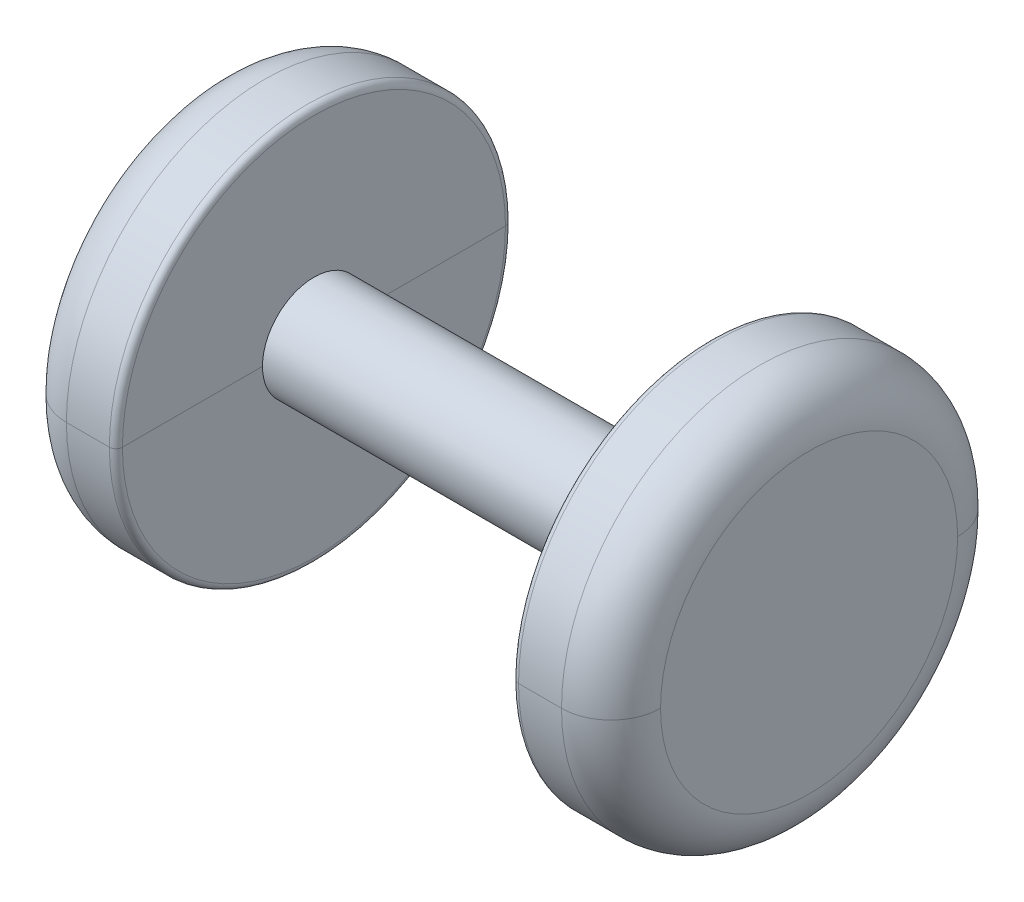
ISO-10303-21;
HEADER;
FILE_DESCRIPTION(('STEP AP214'),'2;1');
FILE_NAME('part.step','',(''),(''),'','','');
FILE_SCHEMA(('AUTOMOTIVE_DESIGN { 1 0 10303 214 1 1 1 1 }'));
ENDSEC;
DATA;
#1=APPLICATION_CONTEXT('core data for automotive mechanical design processes');
#2=APPLICATION_PROTOCOL_DEFINITION('international standard','automotive_design',2000,#1);
#3=PRODUCT_CONTEXT('',#1,'mechanical');
#4=PRODUCT('Part','Part','',(#3));
#5=PRODUCT_RELATED_PRODUCT_CATEGORY('part','',(#4));
#6=PRODUCT_DEFINITION_FORMATION('','',#4);
#7=PRODUCT_DEFINITION_CONTEXT('part definition',#1,'design');
#8=PRODUCT_DEFINITION('design','',#6,#7);
#9=PRODUCT_DEFINITION_SHAPE('','',#8);
#10=(LENGTH_UNIT() NAMED_UNIT(*) SI_UNIT(.MILLI.,.METRE.));
#11=(NAMED_UNIT(*) PLANE_ANGLE_UNIT() SI_UNIT($,.RADIAN.));
#12=(NAMED_UNIT(*) SI_UNIT($,.STERADIAN.) SOLID_ANGLE_UNIT());
#13=UNCERTAINTY_MEASURE_WITH_UNIT(LENGTH_MEASURE(1.E-05),#10,'distance_accuracy_value','');
#14=(GEOMETRIC_REPRESENTATION_CONTEXT(3) GLOBAL_UNCERTAINTY_ASSIGNED_CONTEXT((#13)) GLOBAL_UNIT_ASSIGNED_CONTEXT((#10,
#11,#12)) REPRESENTATION_CONTEXT('',''));
#15=CARTESIAN_POINT('',(0.,0.,0.));
#16=DIRECTION('',(0.,0.,1.));
#17=DIRECTION('',(1.,0.,0.));
#18=AXIS2_PLACEMENT_3D('',#15,#16,#17);
#19=CARTESIAN_POINT('',(31.75,0.,0.));
#20=DIRECTION('',(1.,0.,0.));
#21=DIRECTION('',(0.,0.,-1.));
#22=AXIS2_PLACEMENT_3D('',#19,#20,#21);
#23=TOROIDAL_SURFACE('',#22,19.05,6.35);
#24=CARTESIAN_POINT('',(38.1,0.,0.));
#25=DIRECTION('',(1.,0.,0.));
#26=DIRECTION('',(0.,0.,-1.));
#27=AXIS2_PLACEMENT_3D('',#24,#25,#26);
#28=CIRCLE('',#27,19.05);
#29=CARTESIAN_POINT('',(38.1,0.,19.05));
#30=VERTEX_POINT('',#29);
#31=CARTESIAN_POINT('',(38.1,0.,-19.05));
#32=VERTEX_POINT('',#31);
#33=EDGE_CURVE('E255',#30,#32,#28,.T.);
#34=ORIENTED_EDGE('',*,*,#33,.F.);
#35=CARTESIAN_POINT('',(31.75,0.,19.05));
#36=DIRECTION('',(0.,1.,0.));
#37=DIRECTION('',(0.,0.,1.));
#38=AXIS2_PLACEMENT_3D('',#35,#36,#37);
#39=CIRCLE('',#38,6.35);
#40=CARTESIAN_POINT('',(31.75,0.,25.4));
#41=VERTEX_POINT('',#40);
#42=EDGE_CURVE('E11',#30,#41,#39,.F.);
#43=ORIENTED_EDGE('',*,*,#42,.T.);
#44=CARTESIAN_POINT('',(31.75,0.,0.));
#45=DIRECTION('',(1.,0.,0.));
#46=DIRECTION('',(0.,0.,-1.));
#47=AXIS2_PLACEMENT_3D('',#44,#45,#46);
#48=CIRCLE('',#47,25.4);
#49=CARTESIAN_POINT('',(31.75,0.,-25.4));
#50=VERTEX_POINT('',#49);
#51=EDGE_CURVE('E249',#50,#41,#48,.F.);
#52=ORIENTED_EDGE('',*,*,#51,.F.);
#53=CARTESIAN_POINT('',(31.75,0.,-19.05));
#54=DIRECTION('',(0.,1.,0.));
#55=DIRECTION('',(0.,0.,1.));
#56=AXIS2_PLACEMENT_3D('',#53,#54,#55);
#57=CIRCLE('',#56,6.35);
#58=EDGE_CURVE('E56',#50,#32,#57,.F.);
#59=ORIENTED_EDGE('',*,*,#58,.T.);
#60=EDGE_LOOP('',(#34,#43,#52,#59));
#61=FACE_BOUND('',#60,.T.);
#62=ADVANCED_FACE('F46',(#61),#23,.T.);
#63=CARTESIAN_POINT('',(25.4,0.,0.));
#64=DIRECTION('',(1.,0.,0.));
#65=DIRECTION('',(0.,0.,-1.));
#66=AXIS2_PLACEMENT_3D('',#63,#64,#65);
#67=CYLINDRICAL_SURFACE('',#66,25.4);
#68=ORIENTED_EDGE('',*,*,#51,.T.);
#69=DIRECTION('',(1.,0.,0.));
#70=VECTOR('',#69,1.);
#71=CARTESIAN_POINT('',(25.4,0.,25.4));
#72=LINE('',#71,#70);
#73=CARTESIAN_POINT('',(26.2382,0.,25.4));
#74=VERTEX_POINT('',#73);
#75=EDGE_CURVE('E162',#41,#74,#72,.F.);
#76=ORIENTED_EDGE('',*,*,#75,.T.);
#77=CARTESIAN_POINT('',(26.2382,0.,0.));
#78=DIRECTION('',(1.,0.,0.));
#79=DIRECTION('',(0.,0.,-1.));
#80=AXIS2_PLACEMENT_3D('',#77,#78,#79);
#81=CIRCLE('',#80,25.4);
#82=CARTESIAN_POINT('',(26.2382,0.,-25.4));
#83=VERTEX_POINT('',#82);
#84=EDGE_CURVE('E213',#74,#83,#81,.T.);
#85=ORIENTED_EDGE('',*,*,#84,.T.);
#86=DIRECTION('',(1.,0.,0.));
#87=VECTOR('',#86,1.);
#88=CARTESIAN_POINT('',(25.4,0.,-25.4));
#89=LINE('',#88,#87);
#90=EDGE_CURVE('E163',#83,#50,#89,.T.);
#91=ORIENTED_EDGE('',*,*,#90,.T.);
#92=EDGE_LOOP('',(#68,#76,#85,#91));
#93=FACE_BOUND('',#92,.T.);
#94=ADVANCED_FACE('F248',(#93),#67,.T.);
#95=CARTESIAN_POINT('',(26.2382,0.,0.));
#96=DIRECTION('',(1.,0.,0.));
#97=DIRECTION('',(0.,0.,-1.));
#98=AXIS2_PLACEMENT_3D('',#95,#96,#97);
#99=TOROIDAL_SURFACE('',#98,24.5618,0.8382);
#100=ORIENTED_EDGE('',*,*,#84,.F.);
#101=CARTESIAN_POINT('',(26.2382,0.,24.5618));
#102=DIRECTION('',(0.,1.,0.));
#103=DIRECTION('',(0.,0.,1.));
#104=AXIS2_PLACEMENT_3D('',#101,#102,#103);
#105=CIRCLE('',#104,0.8382);
#106=CARTESIAN_POINT('',(25.4,0.,24.5618));
#107=VERTEX_POINT('',#106);
#108=EDGE_CURVE('E167',#74,#107,#105,.F.);
#109=ORIENTED_EDGE('',*,*,#108,.T.);
#110=CARTESIAN_POINT('',(25.4,0.,0.));
#111=DIRECTION('',(1.,0.,0.));
#112=DIRECTION('',(0.,0.,-1.));
#113=AXIS2_PLACEMENT_3D('',#110,#111,#112);
#114=CIRCLE('',#113,24.5618);
#115=CARTESIAN_POINT('',(25.4,0.,-24.5618));
#116=VERTEX_POINT('',#115);
#117=EDGE_CURVE('E204',#116,#107,#114,.F.);
#118=ORIENTED_EDGE('',*,*,#117,.F.);
#119=CARTESIAN_POINT('',(26.2382,0.,-24.5618));
#120=DIRECTION('',(0.,1.,0.));
#121=DIRECTION('',(0.,0.,1.));
#122=AXIS2_PLACEMENT_3D('',#119,#120,#121);
#123=CIRCLE('',#122,0.8382);
#124=EDGE_CURVE('E168',#116,#83,#123,.F.);
#125=ORIENTED_EDGE('',*,*,#124,.T.);
#126=EDGE_LOOP('',(#100,#109,#118,#125));
#127=FACE_BOUND('',#126,.T.);
#128=ADVANCED_FACE('F237',(#127),#99,.T.);
#129=CARTESIAN_POINT('',(25.4,0.,0.));
#130=DIRECTION('',(1.,0.,0.));
#131=DIRECTION('',(0.,0.,-1.));
#132=AXIS2_PLACEMENT_3D('',#129,#130,#131);
#133=PLANE('',#132);
#134=DIRECTION('',(0.,0.,1.));
#135=VECTOR('',#134,1.);
#136=CARTESIAN_POINT('',(25.4,0.,0.));
#137=LINE('',#136,#135);
#138=CARTESIAN_POINT('',(25.4,0.,-6.604));
#139=VERTEX_POINT('',#138);
#140=EDGE_CURVE('E172',#116,#139,#137,.T.);
#141=ORIENTED_EDGE('',*,*,#140,.F.);
#142=ORIENTED_EDGE('',*,*,#117,.T.);
#143=CARTESIAN_POINT('',(25.4,0.,6.604));
#144=VERTEX_POINT('',#143);
#145=EDGE_CURVE('E174',#144,#107,#137,.T.);
#146=ORIENTED_EDGE('',*,*,#145,.F.);
#147=CARTESIAN_POINT('',(25.4,0.,0.));
#148=DIRECTION('',(1.,0.,0.));
#149=DIRECTION('',(0.,0.,-1.));
#150=AXIS2_PLACEMENT_3D('',#147,#148,#149);
#151=CIRCLE('',#150,6.604);
#152=EDGE_CURVE('E260',#144,#139,#151,.T.);
#153=ORIENTED_EDGE('',*,*,#152,.T.);
#154=EDGE_LOOP('',(#141,#142,#146,#153));
#155=FACE_BOUND('',#154,.T.);
#156=ADVANCED_FACE('F263',(#155),#133,.F.);
#157=CARTESIAN_POINT('',(-31.75,0.,0.));
#158=DIRECTION('',(1.,0.,0.));
#159=DIRECTION('',(0.,0.,-1.));
#160=AXIS2_PLACEMENT_3D('',#157,#158,#159);
#161=TOROIDAL_SURFACE('',#160,19.05,6.35);
#162=CARTESIAN_POINT('',(-31.75,0.,0.));
#163=DIRECTION('',(1.,0.,0.));
#164=DIRECTION('',(0.,0.,-1.));
#165=AXIS2_PLACEMENT_3D('',#162,#163,#164);
#166=CIRCLE('',#165,25.4);
#167=CARTESIAN_POINT('',(-31.75,0.,25.4));
#168=VERTEX_POINT('',#167);
#169=CARTESIAN_POINT('',(-31.75,0.,-25.4));
#170=VERTEX_POINT('',#169);
#171=EDGE_CURVE('E199',#168,#170,#166,.T.);
#172=ORIENTED_EDGE('',*,*,#171,.F.);
#173=CARTESIAN_POINT('',(-31.75,0.,19.05));
#174=DIRECTION('',(0.,1.,0.));
#175=DIRECTION('',(0.,0.,1.));
#176=AXIS2_PLACEMENT_3D('',#173,#174,#175);
#177=CIRCLE('',#176,6.35);
#178=CARTESIAN_POINT('',(-38.1,0.,19.05));
#179=VERTEX_POINT('',#178);
#180=EDGE_CURVE('E180',#168,#179,#177,.F.);
#181=ORIENTED_EDGE('',*,*,#180,.T.);
#182=CARTESIAN_POINT('',(-38.1,0.,0.));
#183=DIRECTION('',(1.,0.,0.));
#184=DIRECTION('',(0.,0.,-1.));
#185=AXIS2_PLACEMENT_3D('',#182,#183,#184);
#186=CIRCLE('',#185,19.05);
#187=CARTESIAN_POINT('',(-38.1,0.,-19.05));
#188=VERTEX_POINT('',#187);
#189=EDGE_CURVE('E211',#188,#179,#186,.F.);
#190=ORIENTED_EDGE('',*,*,#189,.F.);
#191=CARTESIAN_POINT('',(-31.75,0.,-19.05));
#192=DIRECTION('',(0.,1.,0.));
#193=DIRECTION('',(0.,0.,1.));
#194=AXIS2_PLACEMENT_3D('',#191,#192,#193);
#195=CIRCLE('',#194,6.35);
#196=EDGE_CURVE('E183',#188,#170,#195,.F.);
#197=ORIENTED_EDGE('',*,*,#196,.T.);
#198=EDGE_LOOP('',(#172,#181,#190,#197));
#199=FACE_BOUND('',#198,.T.);
#200=ADVANCED_FACE('F208',(#199),#161,.T.);
#201=CARTESIAN_POINT('',(-25.4,0.,0.));
#202=DIRECTION('',(-1.,0.,0.));
#203=DIRECTION('',(0.,0.,1.));
#204=AXIS2_PLACEMENT_3D('',#201,#202,#203);
#205=CYLINDRICAL_SURFACE('',#204,25.4);
#206=ORIENTED_EDGE('',*,*,#171,.T.);
#207=DIRECTION('',(-1.,0.,0.));
#208=VECTOR('',#207,1.);
#209=CARTESIAN_POINT('',(-25.4,0.,-25.4));
#210=LINE('',#209,#208);
#211=CARTESIAN_POINT('',(-26.2382,0.,-25.4));
#212=VERTEX_POINT('',#211);
#213=EDGE_CURVE('E187',#170,#212,#210,.F.);
#214=ORIENTED_EDGE('',*,*,#213,.T.);
#215=CARTESIAN_POINT('',(-26.2382,0.,0.));
#216=DIRECTION('',(-1.,0.,0.));
#217=DIRECTION('',(0.,0.,1.));
#218=AXIS2_PLACEMENT_3D('',#215,#216,#217);
#219=CIRCLE('',#218,25.4);
#220=CARTESIAN_POINT('',(-26.2382,0.,25.4));
#221=VERTEX_POINT('',#220);
#222=EDGE_CURVE('E197',#212,#221,#219,.T.);
#223=ORIENTED_EDGE('',*,*,#222,.T.);
#224=DIRECTION('',(-1.,0.,0.));
#225=VECTOR('',#224,1.);
#226=CARTESIAN_POINT('',(-25.4,0.,25.4));
#227=LINE('',#226,#225);
#228=EDGE_CURVE('E184',#221,#168,#227,.T.);
#229=ORIENTED_EDGE('',*,*,#228,.T.);
#230=EDGE_LOOP('',(#206,#214,#223,#229));
#231=FACE_BOUND('',#230,.T.);
#232=ADVANCED_FACE('F196',(#231),#205,.T.);
#233=CARTESIAN_POINT('',(-26.2382,0.,0.));
#234=DIRECTION('',(-1.,0.,0.));
#235=DIRECTION('',(0.,0.,1.));
#236=AXIS2_PLACEMENT_3D('',#233,#234,#235);
#237=TOROIDAL_SURFACE('',#236,24.5618,0.8382);
#238=ORIENTED_EDGE('',*,*,#222,.F.);
#239=CARTESIAN_POINT('',(-26.2382,0.,-24.5618));
#240=DIRECTION('',(0.,1.,0.));
#241=DIRECTION('',(0.,0.,1.));
#242=AXIS2_PLACEMENT_3D('',#239,#240,#241);
#243=CIRCLE('',#242,0.8382);
#244=CARTESIAN_POINT('',(-25.4,0.,-24.5618));
#245=VERTEX_POINT('',#244);
#246=EDGE_CURVE('E50',#212,#245,#243,.F.);
#247=ORIENTED_EDGE('',*,*,#246,.T.);
#248=CARTESIAN_POINT('',(-25.4,0.,0.));
#249=DIRECTION('',(-1.,0.,0.));
#250=DIRECTION('',(0.,0.,1.));
#251=AXIS2_PLACEMENT_3D('',#248,#249,#250);
#252=CIRCLE('',#251,24.5618);
#253=CARTESIAN_POINT('',(-25.4,0.,24.5618));
#254=VERTEX_POINT('',#253);
#255=EDGE_CURVE('E143',#254,#245,#252,.F.);
#256=ORIENTED_EDGE('',*,*,#255,.F.);
#257=CARTESIAN_POINT('',(-26.2382,0.,24.5618));
#258=DIRECTION('',(0.,1.,0.));
#259=DIRECTION('',(0.,0.,1.));
#260=AXIS2_PLACEMENT_3D('',#257,#258,#259);
#261=CIRCLE('',#260,0.8382);
#262=EDGE_CURVE('E125',#254,#221,#261,.F.);
#263=ORIENTED_EDGE('',*,*,#262,.T.);
#264=EDGE_LOOP('',(#238,#247,#256,#263));
#265=FACE_BOUND('',#264,.T.);
#266=ADVANCED_FACE('F155',(#265),#237,.T.);
#267=CARTESIAN_POINT('',(-25.4,0.,0.));
#268=DIRECTION('',(-1.,0.,0.));
#269=DIRECTION('',(0.,0.,1.));
#270=AXIS2_PLACEMENT_3D('',#267,#268,#269);
#271=PLANE('',#270);
#272=DIRECTION('',(0.,0.,-1.));
#273=VECTOR('',#272,1.);
#274=CARTESIAN_POINT('',(-25.4,0.,0.));
#275=LINE('',#274,#273);
#276=CARTESIAN_POINT('',(-25.4,0.,6.604));
#277=VERTEX_POINT('',#276);
#278=EDGE_CURVE('E138',#254,#277,#275,.T.);
#279=ORIENTED_EDGE('',*,*,#278,.F.);
#280=ORIENTED_EDGE('',*,*,#255,.T.);
#281=CARTESIAN_POINT('',(-25.4,0.,-6.604));
#282=VERTEX_POINT('',#281);
#283=EDGE_CURVE('E150',#282,#245,#275,.T.);
#284=ORIENTED_EDGE('',*,*,#283,.F.);
#285=CARTESIAN_POINT('',(-25.4,0.,0.));
#286=DIRECTION('',(-1.,0.,0.));
#287=DIRECTION('',(0.,0.,1.));
#288=AXIS2_PLACEMENT_3D('',#285,#286,#287);
#289=CIRCLE('',#288,6.604);
#290=EDGE_CURVE('E145',#282,#277,#289,.T.);
#291=ORIENTED_EDGE('',*,*,#290,.T.);
#292=EDGE_LOOP('',(#279,#280,#284,#291));
#293=FACE_BOUND('',#292,.T.);
#294=ADVANCED_FACE('F142',(#293),#271,.F.);
#295=CARTESIAN_POINT('',(38.1,0.,0.));
#296=DIRECTION('',(-1.,0.,0.));
#297=DIRECTION('',(0.,0.,1.));
#298=AXIS2_PLACEMENT_3D('',#295,#296,#297);
#299=CYLINDRICAL_SURFACE('',#298,6.604);
#300=EDGE_CURVE('E258',#139,#144,#151,.T.);
#301=ORIENTED_EDGE('',*,*,#300,.F.);
#302=ORIENTED_EDGE('',*,*,#152,.F.);
#303=EDGE_LOOP('',(#301,#302));
#304=FACE_BOUND('',#303,.T.);
#305=EDGE_CURVE('E256',#277,#282,#289,.T.);
#306=ORIENTED_EDGE('',*,*,#305,.F.);
#307=ORIENTED_EDGE('',*,*,#290,.F.);
#308=EDGE_LOOP('',(#306,#307));
#309=FACE_BOUND('',#308,.T.);
#310=ADVANCED_FACE('F265',(#304,#309),#299,.T.);
#311=ORIENTED_EDGE('',*,*,#75,.F.);
#312=EDGE_CURVE('E245',#41,#50,#48,.F.);
#313=ORIENTED_EDGE('',*,*,#312,.T.);
#314=ORIENTED_EDGE('',*,*,#90,.F.);
#315=EDGE_CURVE('E219',#83,#74,#81,.T.);
#316=ORIENTED_EDGE('',*,*,#315,.T.);
#317=EDGE_LOOP('',(#311,#313,#314,#316));
#318=FACE_BOUND('',#317,.T.);
#319=ADVANCED_FACE('F243',(#318),#67,.T.);
#320=EDGE_CURVE('E221',#107,#116,#114,.F.);
#321=ORIENTED_EDGE('',*,*,#320,.T.);
#322=ORIENTED_EDGE('',*,*,#140,.T.);
#323=ORIENTED_EDGE('',*,*,#300,.T.);
#324=ORIENTED_EDGE('',*,*,#145,.T.);
#325=EDGE_LOOP('',(#321,#322,#323,#324));
#326=FACE_BOUND('',#325,.T.);
#327=ADVANCED_FACE('F230',(#326),#133,.F.);
#328=CARTESIAN_POINT('',(38.1,0.,0.));
#329=DIRECTION('',(1.,0.,0.));
#330=DIRECTION('',(0.,0.,-1.));
#331=AXIS2_PLACEMENT_3D('',#328,#329,#330);
#332=PLANE('',#331);
#333=EDGE_CURVE('E251',#32,#30,#28,.T.);
#334=ORIENTED_EDGE('',*,*,#333,.T.);
#335=ORIENTED_EDGE('',*,*,#33,.T.);
#336=EDGE_LOOP('',(#334,#335));
#337=FACE_BOUND('',#336,.T.);
#338=ADVANCED_FACE('F297',(#337),#332,.T.);
#339=ORIENTED_EDGE('',*,*,#213,.F.);
#340=EDGE_CURVE('E206',#170,#168,#166,.T.);
#341=ORIENTED_EDGE('',*,*,#340,.T.);
#342=ORIENTED_EDGE('',*,*,#228,.F.);
#343=EDGE_CURVE('E132',#221,#212,#219,.T.);
#344=ORIENTED_EDGE('',*,*,#343,.T.);
#345=EDGE_LOOP('',(#339,#341,#342,#344));
#346=FACE_BOUND('',#345,.T.);
#347=ADVANCED_FACE('F205',(#346),#205,.T.);
#348=EDGE_CURVE('E129',#245,#254,#252,.F.);
#349=ORIENTED_EDGE('',*,*,#348,.T.);
#350=ORIENTED_EDGE('',*,*,#278,.T.);
#351=ORIENTED_EDGE('',*,*,#305,.T.);
#352=ORIENTED_EDGE('',*,*,#283,.T.);
#353=EDGE_LOOP('',(#349,#350,#351,#352));
#354=FACE_BOUND('',#353,.T.);
#355=ADVANCED_FACE('F153',(#354),#271,.F.);
#356=CARTESIAN_POINT('',(-38.1,0.,0.));
#357=DIRECTION('',(1.,0.,0.));
#358=DIRECTION('',(0.,0.,-1.));
#359=AXIS2_PLACEMENT_3D('',#356,#357,#358);
#360=PLANE('',#359);
#361=ORIENTED_EDGE('',*,*,#189,.T.);
#362=EDGE_CURVE('E215',#179,#188,#186,.F.);
#363=ORIENTED_EDGE('',*,*,#362,.T.);
#364=EDGE_LOOP('',(#361,#363));
#365=FACE_BOUND('',#364,.T.);
#366=ADVANCED_FACE('F286',(#365),#360,.F.);
#367=ORIENTED_EDGE('',*,*,#42,.F.);
#368=ORIENTED_EDGE('',*,*,#333,.F.);
#369=ORIENTED_EDGE('',*,*,#58,.F.);
#370=ORIENTED_EDGE('',*,*,#312,.F.);
#371=EDGE_LOOP('',(#367,#368,#369,#370));
#372=FACE_BOUND('',#371,.T.);
#373=ADVANCED_FACE('F278',(#372),#23,.T.);
#374=ORIENTED_EDGE('',*,*,#180,.F.);
#375=ORIENTED_EDGE('',*,*,#340,.F.);
#376=ORIENTED_EDGE('',*,*,#196,.F.);
#377=ORIENTED_EDGE('',*,*,#362,.F.);
#378=EDGE_LOOP('',(#374,#375,#376,#377));
#379=FACE_BOUND('',#378,.T.);
#380=ADVANCED_FACE('F285',(#379),#161,.T.);
#381=ORIENTED_EDGE('',*,*,#108,.F.);
#382=ORIENTED_EDGE('',*,*,#315,.F.);
#383=ORIENTED_EDGE('',*,*,#124,.F.);
#384=ORIENTED_EDGE('',*,*,#320,.F.);
#385=EDGE_LOOP('',(#381,#382,#383,#384));
#386=FACE_BOUND('',#385,.T.);
#387=ADVANCED_FACE('F240',(#386),#99,.T.);
#388=ORIENTED_EDGE('',*,*,#246,.F.);
#389=ORIENTED_EDGE('',*,*,#343,.F.);
#390=ORIENTED_EDGE('',*,*,#262,.F.);
#391=ORIENTED_EDGE('',*,*,#348,.F.);
#392=EDGE_LOOP('',(#388,#389,#390,#391));
#393=FACE_BOUND('',#392,.T.);
#394=ADVANCED_FACE('F48',(#393),#237,.T.);
#395=CLOSED_SHELL('',(#62,#94,#128,#156,#200,#232,#266,#294,#310,#319,#327,#338,#347,#355,#366,
#373,#380,#387,#394));
#396=MANIFOLD_SOLID_BREP('B2',#395);
#397=ADVANCED_BREP_SHAPE_REPRESENTATION('',(#18,#396),#14);
#398=SHAPE_DEFINITION_REPRESENTATION(#9,#397);
ENDSEC;
END-ISO-10303-21;
